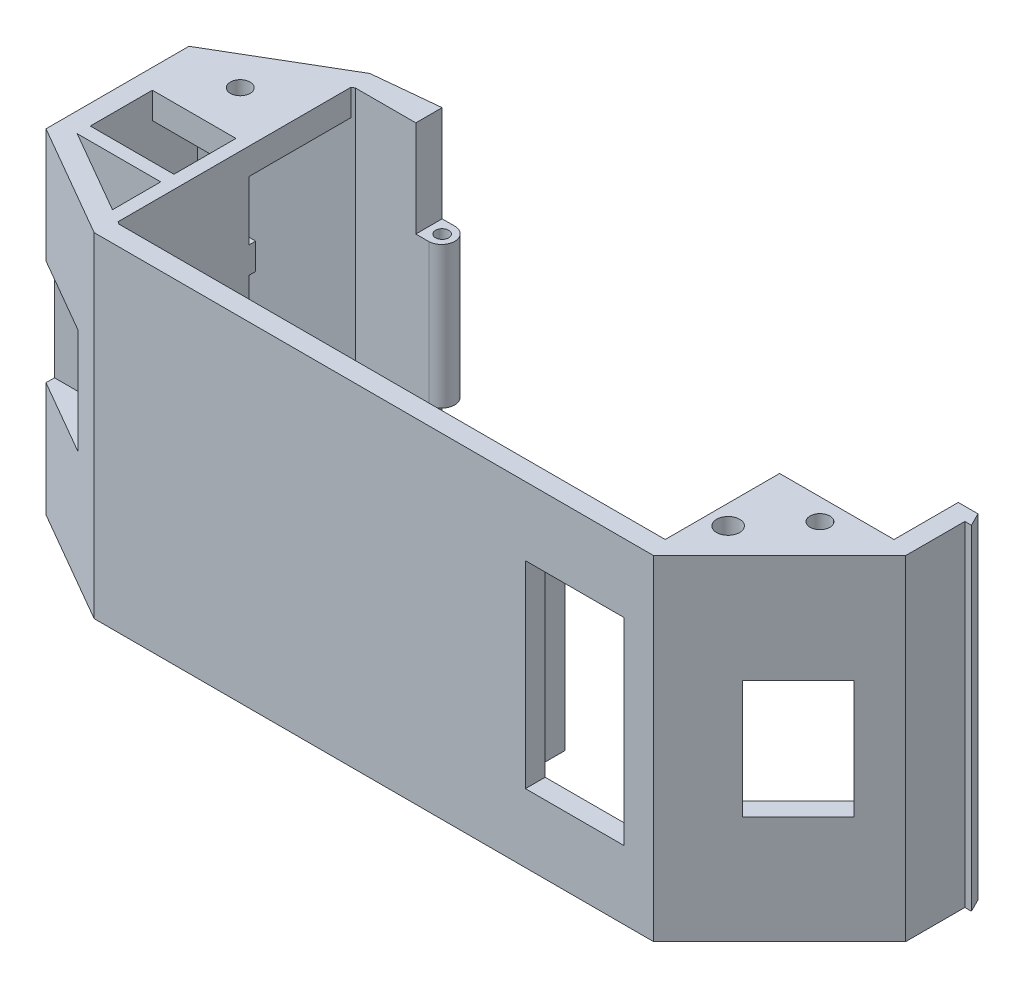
from build123d import *

# Parameters (mm, degrees)
BOSS_EXTRUDE1_DEPTH  = 50.8
SKETCH6_W            = 2
SKETCH6_H            = 50.8
BOSS_EXTRUDE2_DEPTH  = 12.7
BOSS_EXTRUDE3_DEPTH  = 50.8
SKETCH8_W            = 12.7
SKETCH8_H            = 0.998381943
SKETCH8_H_2          = 1.004608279
BOSS_EXTRUDE4_DEPTH  = 9.43
SKETCH9_R            = 4
CUT_EXTRUDE4_DEPTH   = 13
SKETCH10_R           = 4
CUT_EXTRUDE5_DEPTH   = 5
SKETCH11_W           = 7.97
SKETCH11_H           = 16.01
CUT_EXTRUDE6_DEPTH   = 20
SKETCH12_W           = 1
SKETCH12_H           = 4
SKETCH12_W_2         = 6.837949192
BOSS_EXTRUDE7_DEPTH  = 14.7
SKETCH26_W           = 4
SKETCH26_H           = 21.537057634
BOSS_EXTRUDE11_DEPTH = 4
SKETCH30_R           = 1
CUT_EXTRUDE14_DEPTH  = 22
SKETCH5_W            = 15
SKETCH5_H            = 30
CUT_EXTRUDE15_DEPTH  = 10
SKETCH31_W           = 12
SKETCH31_H           = 18
CUT_EXTRUDE16_DEPTH  = 8
SKETCH28_W           = 2
SKETCH28_H           = 50.8
BOSS_EXTRUDE12_DEPTH = 1
SKETCH35_W           = 14.7
SKETCH35_H           = 4
BOSS_EXTRUDE13_DEPTH = 10
CUT_EXTRUDE18_DEPTH  = 55
SKETCH37_R           = 1.5
CUT_EXTRUDE19_DEPTH  = 55
BOSS_EXTRUDE14_DEPTH = 15
CUT_EXTRUDE22_DEPTH  = 55
SKETCH42_R           = 1.7526
SKETCH42_R_2         = 1.5
CUT_EXTRUDE23_DEPTH  = 55
CUT_EXTRUDE24_DEPTH  = 55
SKETCH44_W           = 2
SKETCH44_H           = 30
BOSS_EXTRUDE16_DEPTH = 5


with BuildPart() as part:
    # Sketch1 → Boss-Extrude1 (new body)
    with BuildSketch(Plane(origin=(0, 0, 0), x_dir=(1, 0, 0), z_dir=(0, 1, 0))):
        Polygon((-173.868864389, 0), (-88.868864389, 0), (-69.728898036, 19.139966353), (-69.728898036, 30.139966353), (-72.728898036, 30.139966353), (-72.728898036, 20.38260704), (-90.111505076, 3), (-173.065016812, 3), (-188.189372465, 11.732050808), (-188.189372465, 30), (-173.065016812, 38.87820323), (-163.880478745, 38.87820323), (-163.880478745, 41.87820323), (-163.880478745, 42.87820323), (-173.880478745, 41.87820323), (-191.076526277, 31.783888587), (-191.189372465, 31.712036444), (-191.189372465, 30), (-191.189372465, 10), align=None)
    extrude(amount=BOSS_EXTRUDE1_DEPTH)

    # Sketch6 → Boss-Extrude2 (add)
    with BuildSketch(Plane(origin=(-188.189372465, 0, 0), x_dir=(0, 0, -1), z_dir=(1, 0, 0))):
        with Locations((12.732050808, 25.4)):
            Rectangle(SKETCH6_W, SKETCH6_H)
    extrude(amount=BOSS_EXTRUDE2_DEPTH)

    # Sketch7 → Boss-Extrude3 (add, through all)
    with BuildSketch(Plane(origin=(0, 50.8, 0), x_dir=(1, 0, 0), z_dir=(0, 1, 0))):
        Polygon((-175.489372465, 23.162050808), (-175.489372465, 4.399702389), (-173.489372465, 3.24500185), (-173.489372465, 23.162050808), align=None)
    extrude(amount=-BOSS_EXTRUDE3_DEPTH)

    # Sketch8 → Boss-Extrude4 (add)
    with BuildSketch(Plane(origin=(0, 0, -13.732050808), x_dir=(-1, 0, 0), z_dir=(0, 0, -1))):
        with Locations((181.839372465, 31.250809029)):
            Rectangle(SKETCH8_W, SKETCH8_H)
        with Locations((181.839372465, 19.55230414)):
            Rectangle(SKETCH8_W, SKETCH8_H_2)
    extrude(amount=BOSS_EXTRUDE4_DEPTH)

    # Sketch9 → Cut-Extrude4 (cut)
    with BuildSketch(Plane(origin=(0, 31.75, 0), x_dir=(1, 0, 0), z_dir=(0, 1, 0))):
        with Locations(Location((-181.839372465, 18.447050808, 0), (0, 0, 270))):
            Circle(SKETCH9_R)
    extrude(amount=-CUT_EXTRUDE4_DEPTH, mode=Mode.SUBTRACT)

    # Sketch10 → Cut-Extrude5 (cut)
    with BuildSketch(Plane(origin=(-173.489372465, 0, 0), x_dir=(0, 0, -1), z_dir=(1, 0, 0))):
        with Locations((18.182788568, 25.4)):
            Circle(SKETCH10_R)
    extrude(amount=-CUT_EXTRUDE5_DEPTH, mode=Mode.SUBTRACT)

    # Sketch11 → Cut-Extrude6 (cut)
    with BuildSketch(Plane(origin=(-173.489372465, 0, 0), x_dir=(0, 0, -1), z_dir=(1, 0, 0))):
        with Locations((7.303208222, 25.4)):
            Rectangle(SKETCH11_W, SKETCH11_H)
    extrude(amount=-CUT_EXTRUDE6_DEPTH, mode=Mode.SUBTRACT)

    # Sketch12 → Boss-Extrude7 (add)
    with BuildSketch(Plane(origin=(-188.189372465, 0, 0), x_dir=(0, 0, -1), z_dir=(1, 0, 0))):
        with Locations((23.662050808, 15)):
            Rectangle(SKETCH12_W, SKETCH12_H)
        with Locations((26.581025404, 48.8)):
            Rectangle(SKETCH12_W_2, SKETCH12_H)
        with Locations((26.581025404, 2)):
            Rectangle(SKETCH12_W_2, SKETCH12_H)
        with Locations((23.662050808, 35.8)):
            Rectangle(SKETCH12_W, SKETCH12_H)
    extrude(amount=BOSS_EXTRUDE7_DEPTH)

    # Sketch26 → Boss-Extrude11 (add)
    with BuildSketch(Plane(origin=(-163.880478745, 0, 0), x_dir=(0, 0, -1), z_dir=(1, 0, 0))):
        with Locations((40.87820323, 25.4)):
            Rectangle(SKETCH26_W, SKETCH26_H)
    extrude(amount=BOSS_EXTRUDE11_DEPTH)

    # Sketch30 → Cut-Extrude14 (cut)
    with BuildSketch(Plane(origin=(0, 36.168528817, 0), x_dir=(1, 0, 0), z_dir=(0, 1, 0))):
        with Locations(Location((-161.880478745, 40.87820323, 0), (0, 0, 270))):
            Circle(SKETCH30_R)
        with BuildLine():
            Line((-161.880478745, 42.87820323), (-159.880478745, 42.87820323))
            Line((-159.880478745, 42.87820323), (-159.880478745, 38.87820323))
            Line((-159.880478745, 38.87820323), (-161.880478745, 38.87820323))
            ThreePointArc((-161.880478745, 38.87820323), (-159.96545448, 40.87820323), (-161.880478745, 42.87820323))
        make_face()
    extrude(amount=-CUT_EXTRUDE14_DEPTH, mode=Mode.SUBTRACT)

    # Sketch5 → Cut-Extrude15 (cut)
    with BuildSketch(Plane(origin=(0, 0, -3), x_dir=(-1, 0, 0), z_dir=(0, 0, -1))):
        with Locations((100.84988301, 25.4)):
            Rectangle(SKETCH5_W, SKETCH5_H)
    extrude(amount=-CUT_EXTRUDE15_DEPTH, mode=Mode.SUBTRACT)

    # Sketch31 → Cut-Extrude16 (cut)
    with BuildSketch(Plane(origin=(-44.434432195, 0, -44.434432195), x_dir=(0.7071067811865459, 0, -0.7071067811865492), z_dir=(0.7071067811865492, 0, 0.7071067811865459))):
        with Locations((-47.305776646, 25.4)):
            Rectangle(SKETCH31_W, SKETCH31_H)
    extrude(amount=-CUT_EXTRUDE16_DEPTH, mode=Mode.SUBTRACT)

    # Sketch28 → Boss-Extrude12 (add)
    with BuildSketch(Plane(origin=(-69.728898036, 0, 0), x_dir=(0, 0, -1), z_dir=(1, 0, 0))):
        with Locations((29.139966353, 25.4)):
            Rectangle(SKETCH28_W, SKETCH28_H)
    extrude(amount=BOSS_EXTRUDE12_DEPTH)

    # Sketch35 → Boss-Extrude13 (add)
    with BuildSketch(Plane(origin=(0, 0, -30), x_dir=(-1, 0, 0), z_dir=(0, 0, -1))):
        with Locations((180.839372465, 48.8)):
            Rectangle(SKETCH35_W, SKETCH35_H)
        with Locations((180.839372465, 2)):
            Rectangle(SKETCH35_W, SKETCH35_H)
    extrude(amount=BOSS_EXTRUDE13_DEPTH)

    # Sketch36 → Cut-Extrude18 (cut)
    with BuildSketch(Plane(origin=(0, 50.8, 0), x_dir=(1, 0, 0), z_dir=(0, 1, 0))):
        Polygon((-188.189372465, 33.478687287), (-177.080069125, 40), (-188.189372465, 40), align=None)
    extrude(amount=-CUT_EXTRUDE18_DEPTH, mode=Mode.SUBTRACT)

    # Sketch37 → Cut-Extrude19 (cut)
    with BuildSketch(Plane(origin=(0, 50.8, 0), x_dir=(1, 0, 0), z_dir=(0, 1, 0))):
        with Locations(Location((-181.839372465, 30.162050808, 0), (0, 0, 90))):
            Circle(SKETCH37_R)
    extrude(amount=-CUT_EXTRUDE19_DEPTH, mode=Mode.SUBTRACT)

    # 3DSketch1 → Boss-Extrude14 (add)
    with BuildSketch(Plane(origin=(-72.728898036, 50.8, -20.38260704), x_dir=(-0.3080091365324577, -0.9001448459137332, 0.3080091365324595), z_dir=(-0.7071067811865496, 0, -0.7071067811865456))):
        Polygon((0, 0), (10.70800357, 22.12800747), (15.2087278, 19.950053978), (4.50072423, -2.177953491), align=None)
        Polygon((45.727358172, -22.12800747), (56.435361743, 0), (51.934637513, 2.177953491), (41.226633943, -19.950053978), align=None)
    extrude(amount=BOSS_EXTRUDE14_DEPTH)

    # Sketch41 → Cut-Extrude22 (cut)
    with BuildSketch(Plane.XZ):
        Polygon((-72.728898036, -20.38260704), (-83.335499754, -30.989208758), (-100.718106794, -13.606601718), (-90.111505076, -3), (-90.111505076, -20.38260704), align=None)
    extrude(amount=-CUT_EXTRUDE22_DEPTH, mode=Mode.SUBTRACT)

    # Sketch42 → Cut-Extrude23 (cut)
    with BuildSketch(Plane.XZ):
        with Locations(Location((-87.121364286, -9.569983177, 0), (0, 0, 270))):
            Circle(SKETCH42_R)
        with Locations(Location((-80.705193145, -17.104458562, 0), (0, 0, 270))):
            Circle(SKETCH42_R_2)
    extrude(amount=-CUT_EXTRUDE23_DEPTH, mode=Mode.SUBTRACT)

    # Sketch43 → Cut-Extrude24 (cut)
    with BuildSketch(Plane(origin=(0, 50.8, 0), x_dir=(1, 0, 0), z_dir=(0, 1, 0))):
        Polygon((-68.728898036, 30.139966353), (-68.728898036, 28.139966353), (-69.728898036, 30.139966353), align=None)
    extrude(amount=-CUT_EXTRUDE24_DEPTH, mode=Mode.SUBTRACT)

    # Sketch44 → Boss-Extrude16 (add)
    with BuildSketch(Plane(origin=(0, 0, -3), x_dir=(-1, 0, 0), z_dir=(0, 0, -1))):
        with Locations((111.34988301, 25.4)):
            Rectangle(SKETCH44_W, SKETCH44_H)
    extrude(amount=BOSS_EXTRUDE16_DEPTH)


solid = part.part
